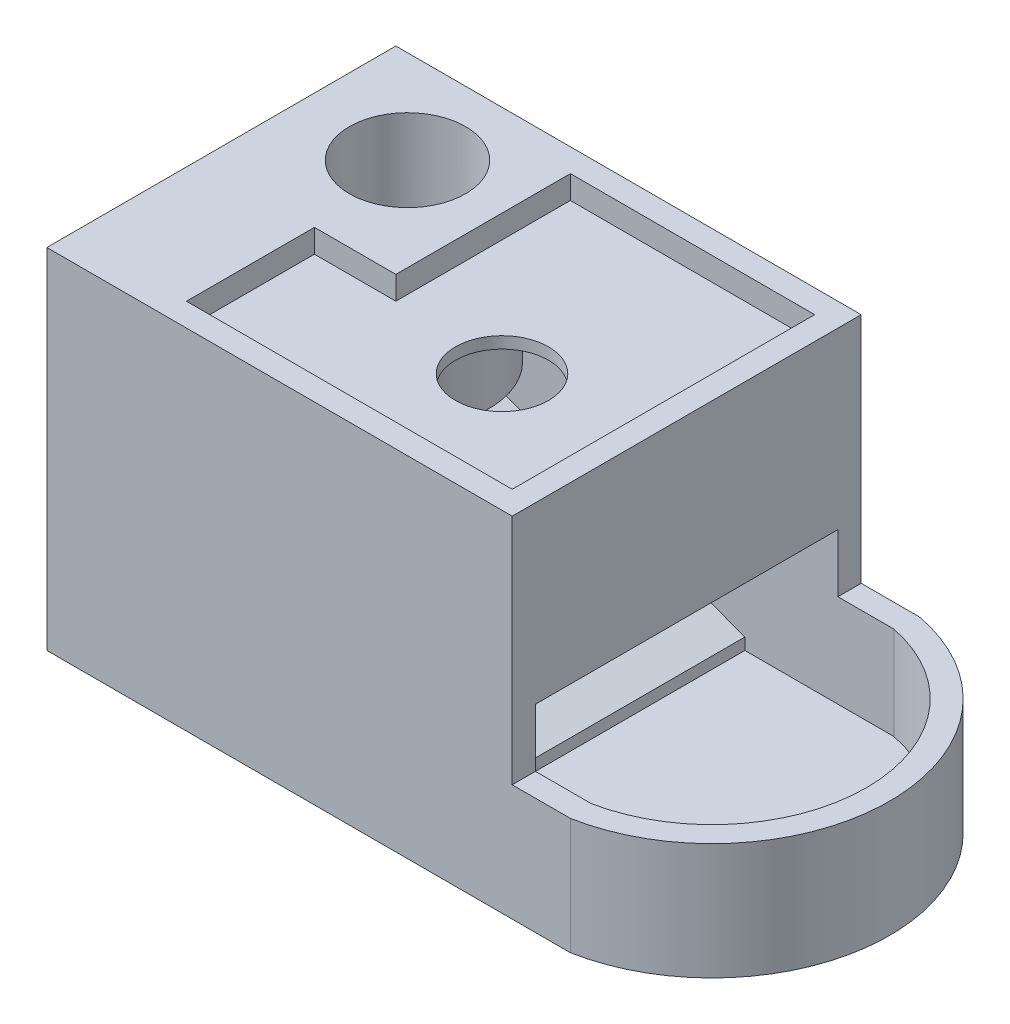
ISO-10303-21;
HEADER;
FILE_DESCRIPTION(('STEP AP214'),'2;1');
FILE_NAME('part.step','',(''),(''),'','','');
FILE_SCHEMA(('AUTOMOTIVE_DESIGN { 1 0 10303 214 1 1 1 1 }'));
ENDSEC;
DATA;
#1=APPLICATION_CONTEXT('core data for automotive mechanical design processes');
#2=APPLICATION_PROTOCOL_DEFINITION('international standard','automotive_design',2000,#1);
#3=PRODUCT_CONTEXT('',#1,'mechanical');
#4=PRODUCT('Part','Part','',(#3));
#5=PRODUCT_RELATED_PRODUCT_CATEGORY('part','',(#4));
#6=PRODUCT_DEFINITION_FORMATION('','',#4);
#7=PRODUCT_DEFINITION_CONTEXT('part definition',#1,'design');
#8=PRODUCT_DEFINITION('design','',#6,#7);
#9=PRODUCT_DEFINITION_SHAPE('','',#8);
#10=(LENGTH_UNIT() NAMED_UNIT(*) SI_UNIT(.MILLI.,.METRE.));
#11=(NAMED_UNIT(*) PLANE_ANGLE_UNIT() SI_UNIT($,.RADIAN.));
#12=(NAMED_UNIT(*) SI_UNIT($,.STERADIAN.) SOLID_ANGLE_UNIT());
#13=UNCERTAINTY_MEASURE_WITH_UNIT(LENGTH_MEASURE(1.E-05),#10,'distance_accuracy_value','');
#14=(GEOMETRIC_REPRESENTATION_CONTEXT(3) GLOBAL_UNCERTAINTY_ASSIGNED_CONTEXT((#13)) GLOBAL_UNIT_ASSIGNED_CONTEXT((#10,
#11,#12)) REPRESENTATION_CONTEXT('',''));
#15=CARTESIAN_POINT('',(0.,0.,0.));
#16=DIRECTION('',(0.,0.,1.));
#17=DIRECTION('',(1.,0.,0.));
#18=AXIS2_PLACEMENT_3D('',#15,#16,#17);
#19=CARTESIAN_POINT('',(3.,27.,41.6173040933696));
#20=DIRECTION('',(0.,1.,0.));
#21=DIRECTION('',(0.,0.,1.));
#22=AXIS2_PLACEMENT_3D('',#19,#20,#21);
#23=PLANE('',#22);
#24=DIRECTION('',(1.,0.,0.));
#25=VECTOR('',#24,1.);
#26=CARTESIAN_POINT('',(3.,27.,-28.));
#27=LINE('',#26,#25);
#28=CARTESIAN_POINT('',(3.,27.,-28.));
#29=VERTEX_POINT('',#28);
#30=CARTESIAN_POINT('',(5.394448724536,27.,-28.));
#31=VERTEX_POINT('',#30);
#32=EDGE_CURVE('E434',#29,#31,#27,.T.);
#33=ORIENTED_EDGE('',*,*,#32,.T.);
#34=CARTESIAN_POINT('',(9.,27.,-22.));
#35=DIRECTION('',(0.,1.,0.));
#36=DIRECTION('',(0.,0.,1.));
#37=AXIS2_PLACEMENT_3D('',#34,#35,#36);
#38=CIRCLE('',#37,7.00000000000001);
#39=CARTESIAN_POINT('',(3.,27.,-25.605551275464));
#40=VERTEX_POINT('',#39);
#41=EDGE_CURVE('E333',#31,#40,#38,.T.);
#42=ORIENTED_EDGE('',*,*,#41,.T.);
#43=DIRECTION('',(0.,0.,-1.));
#44=VECTOR('',#43,1.);
#45=CARTESIAN_POINT('',(3.,27.,41.6173040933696));
#46=LINE('',#45,#44);
#47=EDGE_CURVE('E437',#40,#29,#46,.T.);
#48=ORIENTED_EDGE('',*,*,#47,.T.);
#49=EDGE_LOOP('',(#33,#42,#48));
#50=FACE_BOUND('',#49,.T.);
#51=ADVANCED_FACE('F47',(#50),#23,.F.);
#52=CARTESIAN_POINT('',(0.,30.,0.));
#53=DIRECTION('',(0.,-1.,0.));
#54=DIRECTION('',(0.,0.,-1.));
#55=AXIS2_PLACEMENT_3D('',#52,#53,#54);
#56=PLANE('',#55);
#57=DIRECTION('',(0.,0.,1.));
#58=VECTOR('',#57,1.);
#59=CARTESIAN_POINT('',(0.,30.,0.));
#60=LINE('',#59,#58);
#61=CARTESIAN_POINT('',(0.,30.,-30.));
#62=VERTEX_POINT('',#61);
#63=CARTESIAN_POINT('',(0.,30.,0.));
#64=VERTEX_POINT('',#63);
#65=EDGE_CURVE('E443',#62,#64,#60,.T.);
#66=ORIENTED_EDGE('',*,*,#65,.T.);
#67=DIRECTION('',(1.,0.,0.));
#68=VECTOR('',#67,1.);
#69=CARTESIAN_POINT('',(0.,30.,0.));
#70=LINE('',#69,#68);
#71=CARTESIAN_POINT('',(40.,30.,0.));
#72=VERTEX_POINT('',#71);
#73=EDGE_CURVE('E446',#64,#72,#70,.T.);
#74=ORIENTED_EDGE('',*,*,#73,.T.);
#75=DIRECTION('',(0.,0.,-1.));
#76=VECTOR('',#75,1.);
#77=CARTESIAN_POINT('',(40.,30.,0.));
#78=LINE('',#77,#76);
#79=CARTESIAN_POINT('',(40.,30.,-30.));
#80=VERTEX_POINT('',#79);
#81=EDGE_CURVE('E449',#72,#80,#78,.T.);
#82=ORIENTED_EDGE('',*,*,#81,.T.);
#83=DIRECTION('',(-1.,0.,0.));
#84=VECTOR('',#83,1.);
#85=CARTESIAN_POINT('',(0.,30.,-30.));
#86=LINE('',#85,#84);
#87=EDGE_CURVE('E451',#80,#62,#86,.T.);
#88=ORIENTED_EDGE('',*,*,#87,.T.);
#89=EDGE_LOOP('',(#66,#74,#82,#88));
#90=FACE_BOUND('',#89,.T.);
#91=DIRECTION('',(0.,0.,-1.));
#92=VECTOR('',#91,1.);
#93=CARTESIAN_POINT('',(17.,30.,0.));
#94=LINE('',#93,#92);
#95=CARTESIAN_POINT('',(17.,30.,-13.));
#96=VERTEX_POINT('',#95);
#97=CARTESIAN_POINT('',(17.,30.,-28.));
#98=VERTEX_POINT('',#97);
#99=EDGE_CURVE('E371',#96,#98,#94,.T.);
#100=ORIENTED_EDGE('',*,*,#99,.T.);
#101=DIRECTION('',(1.,0.,0.));
#102=VECTOR('',#101,1.);
#103=CARTESIAN_POINT('',(0.,30.,-28.));
#104=LINE('',#103,#102);
#105=CARTESIAN_POINT('',(38.,30.,-28.));
#106=VERTEX_POINT('',#105);
#107=EDGE_CURVE('E376',#98,#106,#104,.T.);
#108=ORIENTED_EDGE('',*,*,#107,.T.);
#109=DIRECTION('',(0.,0.,1.));
#110=VECTOR('',#109,1.);
#111=CARTESIAN_POINT('',(38.,30.,0.));
#112=LINE('',#111,#110);
#113=CARTESIAN_POINT('',(38.,30.,-2.));
#114=VERTEX_POINT('',#113);
#115=EDGE_CURVE('E400',#106,#114,#112,.T.);
#116=ORIENTED_EDGE('',*,*,#115,.T.);
#117=DIRECTION('',(1.,0.,0.));
#118=VECTOR('',#117,1.);
#119=CARTESIAN_POINT('',(0.,30.,-2.));
#120=LINE('',#119,#118);
#121=CARTESIAN_POINT('',(10.,30.,-2.));
#122=VERTEX_POINT('',#121);
#123=EDGE_CURVE('E397',#122,#114,#120,.T.);
#124=ORIENTED_EDGE('',*,*,#123,.F.);
#125=DIRECTION('',(0.,0.,1.));
#126=VECTOR('',#125,1.);
#127=CARTESIAN_POINT('',(10.,30.,0.));
#128=LINE('',#127,#126);
#129=CARTESIAN_POINT('',(10.,30.,-13.));
#130=VERTEX_POINT('',#129);
#131=EDGE_CURVE('E394',#130,#122,#128,.T.);
#132=ORIENTED_EDGE('',*,*,#131,.F.);
#133=DIRECTION('',(1.,0.,0.));
#134=VECTOR('',#133,1.);
#135=CARTESIAN_POINT('',(0.,30.,-13.));
#136=LINE('',#135,#134);
#137=EDGE_CURVE('E391',#130,#96,#136,.T.);
#138=ORIENTED_EDGE('',*,*,#137,.T.);
#139=EDGE_LOOP('',(#100,#108,#116,#124,#132,#138));
#140=FACE_BOUND('',#139,.T.);
#141=CARTESIAN_POINT('',(9.,30.,-22.));
#142=DIRECTION('',(0.,1.,0.));
#143=DIRECTION('',(0.,0.,1.));
#144=AXIS2_PLACEMENT_3D('',#141,#142,#143);
#145=CIRCLE('',#144,5.);
#146=CARTESIAN_POINT('',(9.,30.,-17.));
#147=VERTEX_POINT('',#146);
#148=EDGE_CURVE('E361',#147,#147,#145,.T.);
#149=ORIENTED_EDGE('',*,*,#148,.F.);
#150=EDGE_LOOP('',(#149));
#151=FACE_BOUND('',#150,.T.);
#152=ADVANCED_FACE('F543',(#90,#140,#151),#56,.F.);
#153=CARTESIAN_POINT('',(0.,30.,0.));
#154=DIRECTION('',(1.,0.,0.));
#155=DIRECTION('',(0.,0.,-1.));
#156=AXIS2_PLACEMENT_3D('',#153,#154,#155);
#157=PLANE('',#156);
#158=DIRECTION('',(0.,-1.,0.));
#159=VECTOR('',#158,1.);
#160=CARTESIAN_POINT('',(0.,30.,-30.));
#161=LINE('',#160,#159);
#162=CARTESIAN_POINT('',(0.,0.,-30.));
#163=VERTEX_POINT('',#162);
#164=EDGE_CURVE('E453',#62,#163,#161,.T.);
#165=ORIENTED_EDGE('',*,*,#164,.T.);
#166=DIRECTION('',(0.,0.,1.));
#167=VECTOR('',#166,1.);
#168=CARTESIAN_POINT('',(0.,0.,0.));
#169=LINE('',#168,#167);
#170=CARTESIAN_POINT('',(0.,0.,0.));
#171=VERTEX_POINT('',#170);
#172=EDGE_CURVE('E427',#163,#171,#169,.T.);
#173=ORIENTED_EDGE('',*,*,#172,.T.);
#174=DIRECTION('',(0.,-1.,0.));
#175=VECTOR('',#174,1.);
#176=CARTESIAN_POINT('',(0.,30.,0.));
#177=LINE('',#176,#175);
#178=EDGE_CURVE('E467',#64,#171,#177,.T.);
#179=ORIENTED_EDGE('',*,*,#178,.F.);
#180=ORIENTED_EDGE('',*,*,#65,.F.);
#181=EDGE_LOOP('',(#165,#173,#179,#180));
#182=FACE_BOUND('',#181,.T.);
#183=ADVANCED_FACE('F49',(#182),#157,.F.);
#184=CARTESIAN_POINT('',(0.,30.,0.));
#185=DIRECTION('',(0.,0.,-1.));
#186=DIRECTION('',(-1.,0.,0.));
#187=AXIS2_PLACEMENT_3D('',#184,#185,#186);
#188=PLANE('',#187);
#189=ORIENTED_EDGE('',*,*,#178,.T.);
#190=DIRECTION('',(1.,0.,0.));
#191=VECTOR('',#190,1.);
#192=CARTESIAN_POINT('',(0.,0.,0.));
#193=LINE('',#192,#191);
#194=CARTESIAN_POINT('',(45.,0.,0.));
#195=VERTEX_POINT('',#194);
#196=EDGE_CURVE('E456',#171,#195,#193,.T.);
#197=ORIENTED_EDGE('',*,*,#196,.T.);
#198=DIRECTION('',(0.,-1.,0.));
#199=VECTOR('',#198,1.);
#200=CARTESIAN_POINT('',(45.,10.,0.));
#201=LINE('',#200,#199);
#202=CARTESIAN_POINT('',(45.,10.,0.));
#203=VERTEX_POINT('',#202);
#204=EDGE_CURVE('E290',#203,#195,#201,.T.);
#205=ORIENTED_EDGE('',*,*,#204,.F.);
#206=DIRECTION('',(-1.,0.,0.));
#207=VECTOR('',#206,1.);
#208=CARTESIAN_POINT('',(0.,10.,0.));
#209=LINE('',#208,#207);
#210=CARTESIAN_POINT('',(40.,10.,0.));
#211=VERTEX_POINT('',#210);
#212=EDGE_CURVE('E285',#203,#211,#209,.T.);
#213=ORIENTED_EDGE('',*,*,#212,.T.);
#214=DIRECTION('',(0.,-1.,0.));
#215=VECTOR('',#214,1.);
#216=CARTESIAN_POINT('',(40.,30.,0.));
#217=LINE('',#216,#215);
#218=EDGE_CURVE('E464',#72,#211,#217,.T.);
#219=ORIENTED_EDGE('',*,*,#218,.F.);
#220=ORIENTED_EDGE('',*,*,#73,.F.);
#221=EDGE_LOOP('',(#189,#197,#205,#213,#219,#220));
#222=FACE_BOUND('',#221,.T.);
#223=ADVANCED_FACE('F662',(#222),#188,.F.);
#224=CARTESIAN_POINT('',(40.,30.,0.));
#225=DIRECTION('',(-1.,0.,0.));
#226=DIRECTION('',(0.,0.,1.));
#227=AXIS2_PLACEMENT_3D('',#224,#225,#226);
#228=PLANE('',#227);
#229=ORIENTED_EDGE('',*,*,#218,.T.);
#230=DIRECTION('',(0.,0.,-1.));
#231=VECTOR('',#230,1.);
#232=CARTESIAN_POINT('',(40.,10.,0.));
#233=LINE('',#232,#231);
#234=CARTESIAN_POINT('',(40.,10.,-2.));
#235=VERTEX_POINT('',#234);
#236=EDGE_CURVE('E57',#211,#235,#233,.T.);
#237=ORIENTED_EDGE('',*,*,#236,.T.);
#238=DIRECTION('',(0.,-1.,0.));
#239=VECTOR('',#238,1.);
#240=CARTESIAN_POINT('',(40.,2.,-2.));
#241=LINE('',#240,#239);
#242=CARTESIAN_POINT('',(40.,15.,-2.));
#243=VERTEX_POINT('',#242);
#244=EDGE_CURVE('E337',#243,#235,#241,.T.);
#245=ORIENTED_EDGE('',*,*,#244,.F.);
#246=DIRECTION('',(0.,0.,1.));
#247=VECTOR('',#246,1.);
#248=CARTESIAN_POINT('',(40.,15.,-2.));
#249=LINE('',#248,#247);
#250=CARTESIAN_POINT('',(40.,15.,-28.));
#251=VERTEX_POINT('',#250);
#252=EDGE_CURVE('E340',#251,#243,#249,.T.);
#253=ORIENTED_EDGE('',*,*,#252,.F.);
#254=DIRECTION('',(0.,1.,0.));
#255=VECTOR('',#254,1.);
#256=CARTESIAN_POINT('',(40.,2.,-28.));
#257=LINE('',#256,#255);
#258=CARTESIAN_POINT('',(40.,10.,-28.));
#259=VERTEX_POINT('',#258);
#260=EDGE_CURVE('E344',#259,#251,#257,.T.);
#261=ORIENTED_EDGE('',*,*,#260,.F.);
#262=CARTESIAN_POINT('',(40.,10.,-30.));
#263=VERTEX_POINT('',#262);
#264=EDGE_CURVE('E12',#259,#263,#233,.T.);
#265=ORIENTED_EDGE('',*,*,#264,.T.);
#266=DIRECTION('',(0.,-1.,0.));
#267=VECTOR('',#266,1.);
#268=CARTESIAN_POINT('',(40.,30.,-30.));
#269=LINE('',#268,#267);
#270=EDGE_CURVE('E461',#80,#263,#269,.T.);
#271=ORIENTED_EDGE('',*,*,#270,.F.);
#272=ORIENTED_EDGE('',*,*,#81,.F.);
#273=EDGE_LOOP('',(#229,#237,#245,#253,#261,#265,#271,#272));
#274=FACE_BOUND('',#273,.T.);
#275=ADVANCED_FACE('F656',(#274),#228,.F.);
#276=CARTESIAN_POINT('',(0.,30.,-30.));
#277=DIRECTION('',(0.,0.,1.));
#278=DIRECTION('',(1.,0.,0.));
#279=AXIS2_PLACEMENT_3D('',#276,#277,#278);
#280=PLANE('',#279);
#281=ORIENTED_EDGE('',*,*,#270,.T.);
#282=DIRECTION('',(1.,0.,0.));
#283=VECTOR('',#282,1.);
#284=CARTESIAN_POINT('',(0.,10.,-30.));
#285=LINE('',#284,#283);
#286=CARTESIAN_POINT('',(45.,10.,-30.));
#287=VERTEX_POINT('',#286);
#288=EDGE_CURVE('E64',#263,#287,#285,.T.);
#289=ORIENTED_EDGE('',*,*,#288,.T.);
#290=DIRECTION('',(0.,-1.,0.));
#291=VECTOR('',#290,1.);
#292=CARTESIAN_POINT('',(45.,10.,-30.));
#293=LINE('',#292,#291);
#294=CARTESIAN_POINT('',(45.,0.,-30.));
#295=VERTEX_POINT('',#294);
#296=EDGE_CURVE('E293',#287,#295,#293,.T.);
#297=ORIENTED_EDGE('',*,*,#296,.T.);
#298=DIRECTION('',(-1.,0.,0.));
#299=VECTOR('',#298,1.);
#300=CARTESIAN_POINT('',(0.,0.,-30.));
#301=LINE('',#300,#299);
#302=EDGE_CURVE('E447',#295,#163,#301,.T.);
#303=ORIENTED_EDGE('',*,*,#302,.T.);
#304=ORIENTED_EDGE('',*,*,#164,.F.);
#305=ORIENTED_EDGE('',*,*,#87,.F.);
#306=EDGE_LOOP('',(#281,#289,#297,#303,#304,#305));
#307=FACE_BOUND('',#306,.T.);
#308=ADVANCED_FACE('F648',(#307),#280,.F.);
#309=CARTESIAN_POINT('',(0.,0.,0.));
#310=DIRECTION('',(0.,-1.,0.));
#311=DIRECTION('',(0.,0.,-1.));
#312=AXIS2_PLACEMENT_3D('',#309,#310,#311);
#313=PLANE('',#312);
#314=ORIENTED_EDGE('',*,*,#172,.F.);
#315=ORIENTED_EDGE('',*,*,#302,.F.);
#316=CARTESIAN_POINT('',(42.1810205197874,0.,-15.));
#317=DIRECTION('',(0.,-1.,0.));
#318=DIRECTION('',(0.,0.,-1.));
#319=AXIS2_PLACEMENT_3D('',#316,#317,#318);
#320=CIRCLE('',#319,15.262589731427);
#321=EDGE_CURVE('E280',#295,#195,#320,.T.);
#322=ORIENTED_EDGE('',*,*,#321,.T.);
#323=ORIENTED_EDGE('',*,*,#196,.F.);
#324=EDGE_LOOP('',(#314,#315,#322,#323));
#325=FACE_BOUND('',#324,.T.);
#326=ADVANCED_FACE('F557',(#325),#313,.T.);
#327=CARTESIAN_POINT('',(17.,28.,0.));
#328=DIRECTION('',(1.,0.,0.));
#329=DIRECTION('',(0.,0.,-1.));
#330=AXIS2_PLACEMENT_3D('',#327,#328,#329);
#331=PLANE('',#330);
#332=ORIENTED_EDGE('',*,*,#99,.F.);
#333=DIRECTION('',(0.,1.,0.));
#334=VECTOR('',#333,1.);
#335=CARTESIAN_POINT('',(17.,28.,-13.));
#336=LINE('',#335,#334);
#337=CARTESIAN_POINT('',(17.,28.,-13.));
#338=VERTEX_POINT('',#337);
#339=EDGE_CURVE('E388',#338,#96,#336,.T.);
#340=ORIENTED_EDGE('',*,*,#339,.F.);
#341=DIRECTION('',(0.,0.,-1.));
#342=VECTOR('',#341,1.);
#343=CARTESIAN_POINT('',(17.,28.,0.));
#344=LINE('',#343,#342);
#345=CARTESIAN_POINT('',(17.,28.,-28.));
#346=VERTEX_POINT('',#345);
#347=EDGE_CURVE('E372',#338,#346,#344,.T.);
#348=ORIENTED_EDGE('',*,*,#347,.T.);
#349=DIRECTION('',(0.,1.,0.));
#350=VECTOR('',#349,1.);
#351=CARTESIAN_POINT('',(17.,28.,-28.));
#352=LINE('',#351,#350);
#353=EDGE_CURVE('E405',#346,#98,#352,.T.);
#354=ORIENTED_EDGE('',*,*,#353,.T.);
#355=EDGE_LOOP('',(#332,#340,#348,#354));
#356=FACE_BOUND('',#355,.T.);
#357=ADVANCED_FACE('F553',(#356),#331,.T.);
#358=CARTESIAN_POINT('',(0.,28.,-28.));
#359=DIRECTION('',(0.,0.,1.));
#360=DIRECTION('',(1.,0.,0.));
#361=AXIS2_PLACEMENT_3D('',#358,#359,#360);
#362=PLANE('',#361);
#363=ORIENTED_EDGE('',*,*,#107,.F.);
#364=ORIENTED_EDGE('',*,*,#353,.F.);
#365=DIRECTION('',(1.,0.,0.));
#366=VECTOR('',#365,1.);
#367=CARTESIAN_POINT('',(0.,28.,-28.));
#368=LINE('',#367,#366);
#369=CARTESIAN_POINT('',(38.,28.,-28.));
#370=VERTEX_POINT('',#369);
#371=EDGE_CURVE('E386',#346,#370,#368,.T.);
#372=ORIENTED_EDGE('',*,*,#371,.T.);
#373=DIRECTION('',(0.,1.,0.));
#374=VECTOR('',#373,1.);
#375=CARTESIAN_POINT('',(38.,28.,-28.));
#376=LINE('',#375,#374);
#377=EDGE_CURVE('E409',#370,#106,#376,.T.);
#378=ORIENTED_EDGE('',*,*,#377,.T.);
#379=EDGE_LOOP('',(#363,#364,#372,#378));
#380=FACE_BOUND('',#379,.T.);
#381=ADVANCED_FACE('F556',(#380),#362,.T.);
#382=CARTESIAN_POINT('',(38.,28.,0.));
#383=DIRECTION('',(-1.,0.,0.));
#384=DIRECTION('',(0.,0.,1.));
#385=AXIS2_PLACEMENT_3D('',#382,#383,#384);
#386=PLANE('',#385);
#387=ORIENTED_EDGE('',*,*,#115,.F.);
#388=ORIENTED_EDGE('',*,*,#377,.F.);
#389=DIRECTION('',(0.,0.,1.));
#390=VECTOR('',#389,1.);
#391=CARTESIAN_POINT('',(38.,28.,0.));
#392=LINE('',#391,#390);
#393=CARTESIAN_POINT('',(38.,28.,-2.));
#394=VERTEX_POINT('',#393);
#395=EDGE_CURVE('E384',#370,#394,#392,.T.);
#396=ORIENTED_EDGE('',*,*,#395,.T.);
#397=DIRECTION('',(0.,1.,0.));
#398=VECTOR('',#397,1.);
#399=CARTESIAN_POINT('',(38.,28.,-2.));
#400=LINE('',#399,#398);
#401=EDGE_CURVE('E411',#394,#114,#400,.T.);
#402=ORIENTED_EDGE('',*,*,#401,.T.);
#403=EDGE_LOOP('',(#387,#388,#396,#402));
#404=FACE_BOUND('',#403,.T.);
#405=ADVANCED_FACE('F571',(#404),#386,.T.);
#406=CARTESIAN_POINT('',(0.,28.,-2.));
#407=DIRECTION('',(0.,0.,1.));
#408=DIRECTION('',(1.,0.,0.));
#409=AXIS2_PLACEMENT_3D('',#406,#407,#408);
#410=PLANE('',#409);
#411=ORIENTED_EDGE('',*,*,#123,.T.);
#412=ORIENTED_EDGE('',*,*,#401,.F.);
#413=DIRECTION('',(1.,0.,0.));
#414=VECTOR('',#413,1.);
#415=CARTESIAN_POINT('',(0.,28.,-2.));
#416=LINE('',#415,#414);
#417=CARTESIAN_POINT('',(10.,28.,-2.));
#418=VERTEX_POINT('',#417);
#419=EDGE_CURVE('E381',#418,#394,#416,.T.);
#420=ORIENTED_EDGE('',*,*,#419,.F.);
#421=DIRECTION('',(0.,1.,0.));
#422=VECTOR('',#421,1.);
#423=CARTESIAN_POINT('',(10.,28.,-2.));
#424=LINE('',#423,#422);
#425=EDGE_CURVE('E413',#418,#122,#424,.T.);
#426=ORIENTED_EDGE('',*,*,#425,.T.);
#427=EDGE_LOOP('',(#411,#412,#420,#426));
#428=FACE_BOUND('',#427,.T.);
#429=ADVANCED_FACE('F567',(#428),#410,.F.);
#430=CARTESIAN_POINT('',(10.,28.,0.));
#431=DIRECTION('',(-1.,0.,0.));
#432=DIRECTION('',(0.,0.,1.));
#433=AXIS2_PLACEMENT_3D('',#430,#431,#432);
#434=PLANE('',#433);
#435=ORIENTED_EDGE('',*,*,#131,.T.);
#436=ORIENTED_EDGE('',*,*,#425,.F.);
#437=DIRECTION('',(0.,0.,1.));
#438=VECTOR('',#437,1.);
#439=CARTESIAN_POINT('',(10.,28.,0.));
#440=LINE('',#439,#438);
#441=CARTESIAN_POINT('',(10.,28.,-13.));
#442=VERTEX_POINT('',#441);
#443=EDGE_CURVE('E378',#442,#418,#440,.T.);
#444=ORIENTED_EDGE('',*,*,#443,.F.);
#445=DIRECTION('',(0.,1.,0.));
#446=VECTOR('',#445,1.);
#447=CARTESIAN_POINT('',(10.,28.,-13.));
#448=LINE('',#447,#446);
#449=EDGE_CURVE('E415',#442,#130,#448,.T.);
#450=ORIENTED_EDGE('',*,*,#449,.T.);
#451=EDGE_LOOP('',(#435,#436,#444,#450));
#452=FACE_BOUND('',#451,.T.);
#453=ADVANCED_FACE('F563',(#452),#434,.F.);
#454=CARTESIAN_POINT('',(0.,28.,-13.));
#455=DIRECTION('',(0.,0.,1.));
#456=DIRECTION('',(1.,0.,0.));
#457=AXIS2_PLACEMENT_3D('',#454,#455,#456);
#458=PLANE('',#457);
#459=ORIENTED_EDGE('',*,*,#137,.F.);
#460=ORIENTED_EDGE('',*,*,#449,.F.);
#461=DIRECTION('',(1.,0.,0.));
#462=VECTOR('',#461,1.);
#463=CARTESIAN_POINT('',(0.,28.,-13.));
#464=LINE('',#463,#462);
#465=EDGE_CURVE('E375',#442,#338,#464,.T.);
#466=ORIENTED_EDGE('',*,*,#465,.T.);
#467=ORIENTED_EDGE('',*,*,#339,.T.);
#468=EDGE_LOOP('',(#459,#460,#466,#467));
#469=FACE_BOUND('',#468,.T.);
#470=ADVANCED_FACE('F559',(#469),#458,.T.);
#471=CARTESIAN_POINT('',(0.,28.,0.));
#472=DIRECTION('',(0.,1.,0.));
#473=DIRECTION('',(0.,0.,1.));
#474=AXIS2_PLACEMENT_3D('',#471,#472,#473);
#475=PLANE('',#474);
#476=CARTESIAN_POINT('',(26.954356,28.,-12.169873));
#477=DIRECTION('',(0.,1.,0.));
#478=DIRECTION('',(0.,0.,1.));
#479=AXIS2_PLACEMENT_3D('',#476,#477,#478);
#480=CIRCLE('',#479,4.);
#481=CARTESIAN_POINT('',(26.954356,28.,-8.169873));
#482=VERTEX_POINT('',#481);
#483=EDGE_CURVE('E358',#482,#482,#480,.T.);
#484=ORIENTED_EDGE('',*,*,#483,.F.);
#485=EDGE_LOOP('',(#484));
#486=FACE_BOUND('',#485,.T.);
#487=ORIENTED_EDGE('',*,*,#347,.F.);
#488=ORIENTED_EDGE('',*,*,#465,.F.);
#489=ORIENTED_EDGE('',*,*,#443,.T.);
#490=ORIENTED_EDGE('',*,*,#419,.T.);
#491=ORIENTED_EDGE('',*,*,#395,.F.);
#492=ORIENTED_EDGE('',*,*,#371,.F.);
#493=EDGE_LOOP('',(#487,#488,#489,#490,#491,#492));
#494=FACE_BOUND('',#493,.T.);
#495=ADVANCED_FACE('F562',(#486,#494),#475,.T.);
#496=CARTESIAN_POINT('',(9.,25.,-22.));
#497=DIRECTION('',(0.,1.,0.));
#498=DIRECTION('',(0.,0.,1.));
#499=AXIS2_PLACEMENT_3D('',#496,#497,#498);
#500=CYLINDRICAL_SURFACE('',#499,5.);
#501=CARTESIAN_POINT('',(9.,17.,-22.));
#502=DIRECTION('',(0.,1.,0.));
#503=DIRECTION('',(0.,0.,1.));
#504=AXIS2_PLACEMENT_3D('',#501,#502,#503);
#505=CIRCLE('',#504,5.);
#506=CARTESIAN_POINT('',(11.5,17.,-17.6698729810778));
#507=VERTEX_POINT('',#506);
#508=CARTESIAN_POINT('',(6.50000000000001,17.,-17.6698729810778));
#509=VERTEX_POINT('',#508);
#510=EDGE_CURVE('E318',#507,#509,#505,.T.);
#511=ORIENTED_EDGE('',*,*,#510,.F.);
#512=DIRECTION('',(0.,1.,0.));
#513=VECTOR('',#512,1.);
#514=CARTESIAN_POINT('',(11.5,17.,-17.6698729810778));
#515=LINE('',#514,#513);
#516=CARTESIAN_POINT('',(11.5,27.,-17.6698729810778));
#517=VERTEX_POINT('',#516);
#518=EDGE_CURVE('E305',#507,#517,#515,.T.);
#519=ORIENTED_EDGE('',*,*,#518,.T.);
#520=CARTESIAN_POINT('',(9.00000000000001,27.,-22.));
#521=DIRECTION('',(0.,1.,0.));
#522=DIRECTION('',(0.,0.,1.));
#523=AXIS2_PLACEMENT_3D('',#520,#521,#522);
#524=CIRCLE('',#523,5.);
#525=CARTESIAN_POINT('',(6.50000000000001,27.,-17.6698729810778));
#526=VERTEX_POINT('',#525);
#527=EDGE_CURVE('E307',#526,#517,#524,.T.);
#528=ORIENTED_EDGE('',*,*,#527,.F.);
#529=DIRECTION('',(0.,1.,0.));
#530=VECTOR('',#529,1.);
#531=CARTESIAN_POINT('',(6.50000000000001,17.,-17.6698729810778));
#532=LINE('',#531,#530);
#533=EDGE_CURVE('E310',#509,#526,#532,.T.);
#534=ORIENTED_EDGE('',*,*,#533,.F.);
#535=EDGE_LOOP('',(#511,#519,#528,#534));
#536=FACE_BOUND('',#535,.T.);
#537=ORIENTED_EDGE('',*,*,#148,.T.);
#538=EDGE_LOOP('',(#537));
#539=FACE_BOUND('',#538,.T.);
#540=ADVANCED_FACE('F497',(#536,#539),#500,.F.);
#541=CARTESIAN_POINT('',(37.,27.,41.6173040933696));
#542=DIRECTION('',(1.,0.,0.));
#543=DIRECTION('',(0.,0.,-1.));
#544=AXIS2_PLACEMENT_3D('',#541,#542,#543);
#545=PLANE('',#544);
#546=DIRECTION('',(0.,-1.,0.));
#547=VECTOR('',#546,1.);
#548=CARTESIAN_POINT('',(37.,27.,-28.));
#549=LINE('',#548,#547);
#550=CARTESIAN_POINT('',(37.,27.,-28.));
#551=VERTEX_POINT('',#550);
#552=CARTESIAN_POINT('',(37.,15.,-28.));
#553=VERTEX_POINT('',#552);
#554=EDGE_CURVE('E408',#551,#553,#549,.T.);
#555=ORIENTED_EDGE('',*,*,#554,.T.);
#556=DIRECTION('',(0.,0.,1.));
#557=VECTOR('',#556,1.);
#558=CARTESIAN_POINT('',(37.,15.,41.6173040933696));
#559=LINE('',#558,#557);
#560=CARTESIAN_POINT('',(37.,15.,-2.));
#561=VERTEX_POINT('',#560);
#562=EDGE_CURVE('E350',#553,#561,#559,.T.);
#563=ORIENTED_EDGE('',*,*,#562,.T.);
#564=DIRECTION('',(0.,1.,0.));
#565=VECTOR('',#564,1.);
#566=CARTESIAN_POINT('',(37.,27.,-2.));
#567=LINE('',#566,#565);
#568=CARTESIAN_POINT('',(37.,27.,-2.));
#569=VERTEX_POINT('',#568);
#570=EDGE_CURVE('E425',#561,#569,#567,.T.);
#571=ORIENTED_EDGE('',*,*,#570,.T.);
#572=DIRECTION('',(0.,0.,-1.));
#573=VECTOR('',#572,1.);
#574=CARTESIAN_POINT('',(37.,27.,41.6173040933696));
#575=LINE('',#574,#573);
#576=EDGE_CURVE('E423',#569,#551,#575,.T.);
#577=ORIENTED_EDGE('',*,*,#576,.T.);
#578=EDGE_LOOP('',(#555,#563,#571,#577));
#579=FACE_BOUND('',#578,.T.);
#580=ADVANCED_FACE('F526',(#579),#545,.F.);
#581=DIRECTION('',(0.,0.,-1.));
#582=VECTOR('',#581,1.);
#583=CARTESIAN_POINT('',(11.5000000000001,27.,41.6173040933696));
#584=LINE('',#583,#582);
#585=CARTESIAN_POINT('',(11.5,27.,-15.461651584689));
#586=VERTEX_POINT('',#585);
#587=EDGE_CURVE('E71',#586,#517,#584,.T.);
#588=ORIENTED_EDGE('',*,*,#587,.F.);
#589=CARTESIAN_POINT('',(12.605551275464,27.,-28.));
#590=VERTEX_POINT('',#589);
#591=EDGE_CURVE('E328',#586,#590,#38,.T.);
#592=ORIENTED_EDGE('',*,*,#591,.T.);
#593=EDGE_CURVE('E433',#590,#551,#27,.T.);
#594=ORIENTED_EDGE('',*,*,#593,.T.);
#595=ORIENTED_EDGE('',*,*,#576,.F.);
#596=DIRECTION('',(-1.,0.,0.));
#597=VECTOR('',#596,1.);
#598=CARTESIAN_POINT('',(3.,27.,-2.));
#599=LINE('',#598,#597);
#600=CARTESIAN_POINT('',(3.,27.,-2.));
#601=VERTEX_POINT('',#600);
#602=EDGE_CURVE('E422',#569,#601,#599,.T.);
#603=ORIENTED_EDGE('',*,*,#602,.T.);
#604=CARTESIAN_POINT('',(3.,27.,-18.394448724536));
#605=VERTEX_POINT('',#604);
#606=EDGE_CURVE('E440',#601,#605,#46,.T.);
#607=ORIENTED_EDGE('',*,*,#606,.T.);
#608=CARTESIAN_POINT('',(6.50000000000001,27.,-15.461651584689));
#609=VERTEX_POINT('',#608);
#610=EDGE_CURVE('E329',#605,#609,#38,.T.);
#611=ORIENTED_EDGE('',*,*,#610,.T.);
#612=DIRECTION('',(0.,0.,1.));
#613=VECTOR('',#612,1.);
#614=CARTESIAN_POINT('',(6.50000000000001,27.,41.6173040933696));
#615=LINE('',#614,#613);
#616=EDGE_CURVE('E302',#526,#609,#615,.T.);
#617=ORIENTED_EDGE('',*,*,#616,.F.);
#618=ORIENTED_EDGE('',*,*,#527,.T.);
#619=EDGE_LOOP('',(#588,#592,#594,#595,#603,#607,#611,#617,#618));
#620=FACE_BOUND('',#619,.T.);
#621=CARTESIAN_POINT('',(26.954356,27.,-12.169873));
#622=DIRECTION('',(0.,1.,0.));
#623=DIRECTION('',(0.,0.,1.));
#624=AXIS2_PLACEMENT_3D('',#621,#622,#623);
#625=CIRCLE('',#624,4.);
#626=CARTESIAN_POINT('',(26.954356,27.,-8.169873));
#627=VERTEX_POINT('',#626);
#628=EDGE_CURVE('E357',#627,#627,#625,.T.);
#629=ORIENTED_EDGE('',*,*,#628,.T.);
#630=EDGE_LOOP('',(#629));
#631=FACE_BOUND('',#630,.T.);
#632=ADVANCED_FACE('F503',(#620,#631),#23,.F.);
#633=CARTESIAN_POINT('',(3.,3.,41.6173040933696));
#634=DIRECTION('',(-1.,0.,0.));
#635=DIRECTION('',(0.,0.,1.));
#636=AXIS2_PLACEMENT_3D('',#633,#634,#635);
#637=PLANE('',#636);
#638=DIRECTION('',(0.,0.,-1.));
#639=VECTOR('',#638,1.);
#640=CARTESIAN_POINT('',(3.,15.,41.6173040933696));
#641=LINE('',#640,#639);
#642=CARTESIAN_POINT('',(3.,15.,-18.394448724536));
#643=VERTEX_POINT('',#642);
#644=CARTESIAN_POINT('',(3.,15.,-25.605551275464));
#645=VERTEX_POINT('',#644);
#646=EDGE_CURVE('E325',#643,#645,#641,.T.);
#647=ORIENTED_EDGE('',*,*,#646,.F.);
#648=DIRECTION('',(0.,1.,0.));
#649=VECTOR('',#648,1.);
#650=CARTESIAN_POINT('',(3.,15.,-18.394448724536));
#651=LINE('',#650,#649);
#652=EDGE_CURVE('E332',#643,#605,#651,.T.);
#653=ORIENTED_EDGE('',*,*,#652,.T.);
#654=ORIENTED_EDGE('',*,*,#606,.F.);
#655=DIRECTION('',(0.,-1.,0.));
#656=VECTOR('',#655,1.);
#657=CARTESIAN_POINT('',(3.,3.,-2.));
#658=LINE('',#657,#656);
#659=CARTESIAN_POINT('',(3.,13.875,-2.));
#660=VERTEX_POINT('',#659);
#661=EDGE_CURVE('E419',#601,#660,#658,.T.);
#662=ORIENTED_EDGE('',*,*,#661,.T.);
#663=DIRECTION('',(0.,0.,-1.));
#664=VECTOR('',#663,1.);
#665=CARTESIAN_POINT('',(3.,13.875,41.6173040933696));
#666=LINE('',#665,#664);
#667=CARTESIAN_POINT('',(3.,13.875,-28.));
#668=VERTEX_POINT('',#667);
#669=EDGE_CURVE('E366',#660,#668,#666,.T.);
#670=ORIENTED_EDGE('',*,*,#669,.T.);
#671=DIRECTION('',(0.,1.,0.));
#672=VECTOR('',#671,1.);
#673=CARTESIAN_POINT('',(3.,3.,-28.));
#674=LINE('',#673,#672);
#675=EDGE_CURVE('E430',#668,#29,#674,.T.);
#676=ORIENTED_EDGE('',*,*,#675,.T.);
#677=ORIENTED_EDGE('',*,*,#47,.F.);
#678=DIRECTION('',(0.,1.,0.));
#679=VECTOR('',#678,1.);
#680=CARTESIAN_POINT('',(3.,15.,-25.605551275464));
#681=LINE('',#680,#679);
#682=EDGE_CURVE('E335',#40,#645,#681,.F.);
#683=ORIENTED_EDGE('',*,*,#682,.T.);
#684=EDGE_LOOP('',(#647,#653,#654,#662,#670,#676,#677,#683));
#685=FACE_BOUND('',#684,.T.);
#686=ADVANCED_FACE('F530',(#685),#637,.F.);
#687=CARTESIAN_POINT('',(0.,0.,-28.));
#688=DIRECTION('',(0.,0.,-1.));
#689=DIRECTION('',(-1.,0.,0.));
#690=AXIS2_PLACEMENT_3D('',#687,#688,#689);
#691=PLANE('',#690);
#692=DIRECTION('',(1.,0.,0.));
#693=VECTOR('',#692,1.);
#694=CARTESIAN_POINT('',(0.,15.,-28.));
#695=LINE('',#694,#693);
#696=CARTESIAN_POINT('',(5.394448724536,15.,-28.));
#697=VERTEX_POINT('',#696);
#698=CARTESIAN_POINT('',(12.605551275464,15.,-28.));
#699=VERTEX_POINT('',#698);
#700=EDGE_CURVE('E472',#697,#699,#695,.T.);
#701=ORIENTED_EDGE('',*,*,#700,.F.);
#702=DIRECTION('',(0.,1.,0.));
#703=VECTOR('',#702,1.);
#704=CARTESIAN_POINT('',(5.394448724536,15.,-28.));
#705=LINE('',#704,#703);
#706=EDGE_CURVE('E478',#697,#31,#705,.T.);
#707=ORIENTED_EDGE('',*,*,#706,.T.);
#708=ORIENTED_EDGE('',*,*,#32,.F.);
#709=ORIENTED_EDGE('',*,*,#675,.F.);
#710=DIRECTION('',(0.936329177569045,-0.351123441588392,0.));
#711=VECTOR('',#710,1.);
#712=CARTESIAN_POINT('',(4.93150684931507,13.1506849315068,-28.));
#713=LINE('',#712,#711);
#714=CARTESIAN_POINT('',(32.,3.,-28.));
#715=VERTEX_POINT('',#714);
#716=EDGE_CURVE('E368',#668,#715,#713,.T.);
#717=ORIENTED_EDGE('',*,*,#716,.T.);
#718=DIRECTION('',(0.,1.,0.));
#719=VECTOR('',#718,1.);
#720=CARTESIAN_POINT('',(32.,2.,-28.));
#721=LINE('',#720,#719);
#722=CARTESIAN_POINT('',(32.,2.,-28.));
#723=VERTEX_POINT('',#722);
#724=EDGE_CURVE('E258',#723,#715,#721,.T.);
#725=ORIENTED_EDGE('',*,*,#724,.F.);
#726=DIRECTION('',(1.,0.,0.));
#727=VECTOR('',#726,1.);
#728=CARTESIAN_POINT('',(32.,2.,-28.));
#729=LINE('',#728,#727);
#730=CARTESIAN_POINT('',(44.8070986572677,2.,-28.));
#731=VERTEX_POINT('',#730);
#732=EDGE_CURVE('E257',#723,#731,#729,.T.);
#733=ORIENTED_EDGE('',*,*,#732,.T.);
#734=DIRECTION('',(0.,1.,0.));
#735=VECTOR('',#734,1.);
#736=CARTESIAN_POINT('',(44.8070986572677,2.,-28.));
#737=LINE('',#736,#735);
#738=CARTESIAN_POINT('',(44.8070986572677,10.,-28.));
#739=VERTEX_POINT('',#738);
#740=EDGE_CURVE('E269',#731,#739,#737,.T.);
#741=ORIENTED_EDGE('',*,*,#740,.T.);
#742=DIRECTION('',(-1.,0.,0.));
#743=VECTOR('',#742,1.);
#744=CARTESIAN_POINT('',(42.,10.,-28.));
#745=LINE('',#744,#743);
#746=EDGE_CURVE('E273',#739,#259,#745,.T.);
#747=ORIENTED_EDGE('',*,*,#746,.T.);
#748=ORIENTED_EDGE('',*,*,#260,.T.);
#749=DIRECTION('',(1.,0.,0.));
#750=VECTOR('',#749,1.);
#751=CARTESIAN_POINT('',(32.,15.,-28.));
#752=LINE('',#751,#750);
#753=EDGE_CURVE('E351',#553,#251,#752,.T.);
#754=ORIENTED_EDGE('',*,*,#753,.F.);
#755=ORIENTED_EDGE('',*,*,#554,.F.);
#756=ORIENTED_EDGE('',*,*,#593,.F.);
#757=DIRECTION('',(0.,1.,0.));
#758=VECTOR('',#757,1.);
#759=CARTESIAN_POINT('',(12.605551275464,15.,-28.));
#760=LINE('',#759,#758);
#761=EDGE_CURVE('E477',#590,#699,#760,.F.);
#762=ORIENTED_EDGE('',*,*,#761,.T.);
#763=EDGE_LOOP('',(#701,#707,#708,#709,#717,#725,#733,#741,#747,#748,#754,#755,#756,#762));
#764=FACE_BOUND('',#763,.T.);
#765=ADVANCED_FACE('F514',(#764),#691,.F.);
#766=CARTESIAN_POINT('',(0.,30.,-2.));
#767=DIRECTION('',(0.,0.,-1.));
#768=DIRECTION('',(-1.,0.,0.));
#769=AXIS2_PLACEMENT_3D('',#766,#767,#768);
#770=PLANE('',#769);
#771=ORIENTED_EDGE('',*,*,#570,.F.);
#772=DIRECTION('',(1.,0.,0.));
#773=VECTOR('',#772,1.);
#774=CARTESIAN_POINT('',(32.,15.,-2.));
#775=LINE('',#774,#773);
#776=EDGE_CURVE('E348',#561,#243,#775,.T.);
#777=ORIENTED_EDGE('',*,*,#776,.T.);
#778=ORIENTED_EDGE('',*,*,#244,.T.);
#779=DIRECTION('',(1.,0.,0.));
#780=VECTOR('',#779,1.);
#781=CARTESIAN_POINT('',(42.,10.,-2.));
#782=LINE('',#781,#780);
#783=CARTESIAN_POINT('',(44.8070986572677,10.,-2.));
#784=VERTEX_POINT('',#783);
#785=EDGE_CURVE('E265',#235,#784,#782,.T.);
#786=ORIENTED_EDGE('',*,*,#785,.T.);
#787=DIRECTION('',(0.,1.,0.));
#788=VECTOR('',#787,1.);
#789=CARTESIAN_POINT('',(44.8070986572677,2.,-2.));
#790=LINE('',#789,#788);
#791=CARTESIAN_POINT('',(44.8070986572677,2.,-2.));
#792=VERTEX_POINT('',#791);
#793=EDGE_CURVE('E261',#792,#784,#790,.T.);
#794=ORIENTED_EDGE('',*,*,#793,.F.);
#795=DIRECTION('',(1.,0.,0.));
#796=VECTOR('',#795,1.);
#797=CARTESIAN_POINT('',(32.,2.,-2.));
#798=LINE('',#797,#796);
#799=CARTESIAN_POINT('',(32.,2.,-2.));
#800=VERTEX_POINT('',#799);
#801=EDGE_CURVE('E248',#800,#792,#798,.T.);
#802=ORIENTED_EDGE('',*,*,#801,.F.);
#803=DIRECTION('',(0.,-1.,0.));
#804=VECTOR('',#803,1.);
#805=CARTESIAN_POINT('',(32.,2.,-2.));
#806=LINE('',#805,#804);
#807=CARTESIAN_POINT('',(32.,3.,-2.));
#808=VERTEX_POINT('',#807);
#809=EDGE_CURVE('E338',#808,#800,#806,.T.);
#810=ORIENTED_EDGE('',*,*,#809,.F.);
#811=DIRECTION('',(0.936329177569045,-0.351123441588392,0.));
#812=VECTOR('',#811,1.);
#813=CARTESIAN_POINT('',(-4.93150684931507,16.8493150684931,-2.));
#814=LINE('',#813,#812);
#815=EDGE_CURVE('E469',#660,#808,#814,.T.);
#816=ORIENTED_EDGE('',*,*,#815,.F.);
#817=ORIENTED_EDGE('',*,*,#661,.F.);
#818=ORIENTED_EDGE('',*,*,#602,.F.);
#819=EDGE_LOOP('',(#771,#777,#778,#786,#794,#802,#810,#816,#817,#818));
#820=FACE_BOUND('',#819,.T.);
#821=ADVANCED_FACE('F263',(#820),#770,.T.);
#822=CARTESIAN_POINT('',(40.,0.,0.));
#823=DIRECTION('',(0.351123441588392,0.936329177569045,0.));
#824=DIRECTION('',(-0.936329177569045,0.351123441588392,0.));
#825=AXIS2_PLACEMENT_3D('',#822,#823,#824);
#826=PLANE('',#825);
#827=ORIENTED_EDGE('',*,*,#716,.F.);
#828=ORIENTED_EDGE('',*,*,#669,.F.);
#829=ORIENTED_EDGE('',*,*,#815,.T.);
#830=DIRECTION('',(0.,0.,1.));
#831=VECTOR('',#830,1.);
#832=CARTESIAN_POINT('',(32.,3.,41.6173040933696));
#833=LINE('',#832,#831);
#834=EDGE_CURVE('E364',#715,#808,#833,.T.);
#835=ORIENTED_EDGE('',*,*,#834,.F.);
#836=EDGE_LOOP('',(#827,#828,#829,#835));
#837=FACE_BOUND('',#836,.T.);
#838=ADVANCED_FACE('F552',(#837),#826,.T.);
#839=CARTESIAN_POINT('',(26.954356,25.,-12.169873));
#840=DIRECTION('',(0.,1.,0.));
#841=DIRECTION('',(0.,0.,1.));
#842=AXIS2_PLACEMENT_3D('',#839,#840,#841);
#843=CYLINDRICAL_SURFACE('',#842,4.);
#844=ORIENTED_EDGE('',*,*,#483,.T.);
#845=EDGE_LOOP('',(#844));
#846=FACE_BOUND('',#845,.T.);
#847=ORIENTED_EDGE('',*,*,#628,.F.);
#848=EDGE_LOOP('',(#847));
#849=FACE_BOUND('',#848,.T.);
#850=ADVANCED_FACE('F584',(#846,#849),#843,.F.);
#851=CARTESIAN_POINT('',(32.,15.,-2.));
#852=DIRECTION('',(0.,1.,0.));
#853=DIRECTION('',(0.,0.,1.));
#854=AXIS2_PLACEMENT_3D('',#851,#852,#853);
#855=PLANE('',#854);
#856=ORIENTED_EDGE('',*,*,#753,.T.);
#857=ORIENTED_EDGE('',*,*,#252,.T.);
#858=ORIENTED_EDGE('',*,*,#776,.F.);
#859=ORIENTED_EDGE('',*,*,#562,.F.);
#860=EDGE_LOOP('',(#856,#857,#858,#859));
#861=FACE_BOUND('',#860,.T.);
#862=ADVANCED_FACE('F590',(#861),#855,.F.);
#863=CARTESIAN_POINT('',(32.,2.,-2.));
#864=DIRECTION('',(0.,-1.,0.));
#865=DIRECTION('',(0.,0.,-1.));
#866=AXIS2_PLACEMENT_3D('',#863,#864,#865);
#867=PLANE('',#866);
#868=ORIENTED_EDGE('',*,*,#801,.T.);
#869=CARTESIAN_POINT('',(42.1810205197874,2.,-15.));
#870=DIRECTION('',(0.,1.,0.));
#871=DIRECTION('',(0.,0.,1.));
#872=AXIS2_PLACEMENT_3D('',#869,#870,#871);
#873=CIRCLE('',#872,13.262589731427);
#874=EDGE_CURVE('E252',#792,#731,#873,.T.);
#875=ORIENTED_EDGE('',*,*,#874,.T.);
#876=ORIENTED_EDGE('',*,*,#732,.F.);
#877=DIRECTION('',(0.,0.,-1.));
#878=VECTOR('',#877,1.);
#879=CARTESIAN_POINT('',(32.,2.,-2.));
#880=LINE('',#879,#878);
#881=EDGE_CURVE('E254',#800,#723,#880,.T.);
#882=ORIENTED_EDGE('',*,*,#881,.F.);
#883=EDGE_LOOP('',(#868,#875,#876,#882));
#884=FACE_BOUND('',#883,.T.);
#885=ADVANCED_FACE('F250',(#884),#867,.F.);
#886=CARTESIAN_POINT('',(32.,0.,0.));
#887=DIRECTION('',(-1.,0.,0.));
#888=DIRECTION('',(0.,0.,1.));
#889=AXIS2_PLACEMENT_3D('',#886,#887,#888);
#890=PLANE('',#889);
#891=ORIENTED_EDGE('',*,*,#834,.T.);
#892=ORIENTED_EDGE('',*,*,#809,.T.);
#893=ORIENTED_EDGE('',*,*,#881,.T.);
#894=ORIENTED_EDGE('',*,*,#724,.T.);
#895=EDGE_LOOP('',(#891,#892,#893,#894));
#896=FACE_BOUND('',#895,.T.);
#897=ADVANCED_FACE('F594',(#896),#890,.F.);
#898=CARTESIAN_POINT('',(9.,15.,-22.));
#899=DIRECTION('',(0.,1.,0.));
#900=DIRECTION('',(0.,0.,1.));
#901=AXIS2_PLACEMENT_3D('',#898,#899,#900);
#902=CYLINDRICAL_SURFACE('',#901,7.00000000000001);
#903=ORIENTED_EDGE('',*,*,#682,.F.);
#904=ORIENTED_EDGE('',*,*,#41,.F.);
#905=ORIENTED_EDGE('',*,*,#706,.F.);
#906=CARTESIAN_POINT('',(9.,15.,-22.));
#907=DIRECTION('',(0.,1.,0.));
#908=DIRECTION('',(0.,0.,1.));
#909=AXIS2_PLACEMENT_3D('',#906,#907,#908);
#910=CIRCLE('',#909,7.00000000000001);
#911=EDGE_CURVE('E324',#697,#645,#910,.T.);
#912=ORIENTED_EDGE('',*,*,#911,.T.);
#913=EDGE_LOOP('',(#903,#904,#905,#912));
#914=FACE_BOUND('',#913,.T.);
#915=ADVANCED_FACE('F519',(#914),#902,.T.);
#916=DIRECTION('',(0.,1.,0.));
#917=VECTOR('',#916,1.);
#918=CARTESIAN_POINT('',(11.5,15.,-15.461651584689));
#919=LINE('',#918,#917);
#920=CARTESIAN_POINT('',(11.5,17.,-15.461651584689));
#921=VERTEX_POINT('',#920);
#922=EDGE_CURVE('E316',#921,#586,#919,.T.);
#923=ORIENTED_EDGE('',*,*,#922,.F.);
#924=CARTESIAN_POINT('',(9.,17.,-22.));
#925=DIRECTION('',(0.,1.,0.));
#926=DIRECTION('',(0.,0.,1.));
#927=AXIS2_PLACEMENT_3D('',#924,#925,#926);
#928=CIRCLE('',#927,7.00000000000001);
#929=CARTESIAN_POINT('',(6.50000000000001,17.,-15.461651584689));
#930=VERTEX_POINT('',#929);
#931=EDGE_CURVE('E51',#921,#930,#928,.F.);
#932=ORIENTED_EDGE('',*,*,#931,.T.);
#933=DIRECTION('',(0.,1.,0.));
#934=VECTOR('',#933,1.);
#935=CARTESIAN_POINT('',(6.50000000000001,15.,-15.461651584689));
#936=LINE('',#935,#934);
#937=EDGE_CURVE('E312',#609,#930,#936,.F.);
#938=ORIENTED_EDGE('',*,*,#937,.F.);
#939=ORIENTED_EDGE('',*,*,#610,.F.);
#940=ORIENTED_EDGE('',*,*,#652,.F.);
#941=EDGE_CURVE('E321',#643,#699,#910,.T.);
#942=ORIENTED_EDGE('',*,*,#941,.T.);
#943=ORIENTED_EDGE('',*,*,#761,.F.);
#944=ORIENTED_EDGE('',*,*,#591,.F.);
#945=EDGE_LOOP('',(#923,#932,#938,#939,#940,#942,#943,#944));
#946=FACE_BOUND('',#945,.T.);
#947=ADVANCED_FACE('F486',(#946),#902,.T.);
#948=CARTESIAN_POINT('',(9.,15.,-22.));
#949=DIRECTION('',(0.,1.,0.));
#950=DIRECTION('',(0.,0.,1.));
#951=AXIS2_PLACEMENT_3D('',#948,#949,#950);
#952=PLANE('',#951);
#953=ORIENTED_EDGE('',*,*,#941,.F.);
#954=ORIENTED_EDGE('',*,*,#646,.T.);
#955=ORIENTED_EDGE('',*,*,#911,.F.);
#956=ORIENTED_EDGE('',*,*,#700,.T.);
#957=EDGE_LOOP('',(#953,#954,#955,#956));
#958=FACE_BOUND('',#957,.T.);
#959=ADVANCED_FACE('F511',(#958),#952,.F.);
#960=CARTESIAN_POINT('',(9.,17.,-22.));
#961=DIRECTION('',(0.,1.,0.));
#962=DIRECTION('',(0.,0.,1.));
#963=AXIS2_PLACEMENT_3D('',#960,#961,#962);
#964=PLANE('',#963);
#965=ORIENTED_EDGE('',*,*,#510,.T.);
#966=DIRECTION('',(0.,0.,1.));
#967=VECTOR('',#966,1.);
#968=CARTESIAN_POINT('',(6.50000000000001,17.,41.6173040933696));
#969=LINE('',#968,#967);
#970=EDGE_CURVE('E301',#509,#930,#969,.T.);
#971=ORIENTED_EDGE('',*,*,#970,.T.);
#972=ORIENTED_EDGE('',*,*,#931,.F.);
#973=DIRECTION('',(0.,0.,-1.));
#974=VECTOR('',#973,1.);
#975=CARTESIAN_POINT('',(11.5000000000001,17.,41.6173040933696));
#976=LINE('',#975,#974);
#977=EDGE_CURVE('E298',#921,#507,#976,.T.);
#978=ORIENTED_EDGE('',*,*,#977,.T.);
#979=EDGE_LOOP('',(#965,#971,#972,#978));
#980=FACE_BOUND('',#979,.T.);
#981=ADVANCED_FACE('F491',(#980),#964,.T.);
#982=CARTESIAN_POINT('',(11.5000000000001,17.,41.6173040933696));
#983=DIRECTION('',(1.,0.,0.));
#984=DIRECTION('',(0.,0.,-1.));
#985=AXIS2_PLACEMENT_3D('',#982,#983,#984);
#986=PLANE('',#985);
#987=ORIENTED_EDGE('',*,*,#922,.T.);
#988=ORIENTED_EDGE('',*,*,#587,.T.);
#989=ORIENTED_EDGE('',*,*,#518,.F.);
#990=ORIENTED_EDGE('',*,*,#977,.F.);
#991=EDGE_LOOP('',(#987,#988,#989,#990));
#992=FACE_BOUND('',#991,.T.);
#993=ADVANCED_FACE('F494',(#992),#986,.F.);
#994=CARTESIAN_POINT('',(6.50000000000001,17.,41.6173040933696));
#995=DIRECTION('',(-1.,0.,0.));
#996=DIRECTION('',(0.,0.,1.));
#997=AXIS2_PLACEMENT_3D('',#994,#995,#996);
#998=PLANE('',#997);
#999=ORIENTED_EDGE('',*,*,#937,.T.);
#1000=ORIENTED_EDGE('',*,*,#970,.F.);
#1001=ORIENTED_EDGE('',*,*,#533,.T.);
#1002=ORIENTED_EDGE('',*,*,#616,.T.);
#1003=EDGE_LOOP('',(#999,#1000,#1001,#1002));
#1004=FACE_BOUND('',#1003,.T.);
#1005=ADVANCED_FACE('F502',(#1004),#998,.F.);
#1006=CARTESIAN_POINT('',(42.1810205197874,10.,-15.));
#1007=DIRECTION('',(0.,-1.,0.));
#1008=DIRECTION('',(0.,0.,-1.));
#1009=AXIS2_PLACEMENT_3D('',#1006,#1007,#1008);
#1010=CYLINDRICAL_SURFACE('',#1009,15.262589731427);
#1011=ORIENTED_EDGE('',*,*,#321,.F.);
#1012=ORIENTED_EDGE('',*,*,#296,.F.);
#1013=CARTESIAN_POINT('',(42.1810205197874,10.,-15.));
#1014=DIRECTION('',(0.,-1.,0.));
#1015=DIRECTION('',(0.,0.,-1.));
#1016=AXIS2_PLACEMENT_3D('',#1013,#1014,#1015);
#1017=CIRCLE('',#1016,15.262589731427);
#1018=EDGE_CURVE('E282',#287,#203,#1017,.T.);
#1019=ORIENTED_EDGE('',*,*,#1018,.T.);
#1020=ORIENTED_EDGE('',*,*,#204,.T.);
#1021=EDGE_LOOP('',(#1011,#1012,#1019,#1020));
#1022=FACE_BOUND('',#1021,.T.);
#1023=ADVANCED_FACE('F611',(#1022),#1010,.T.);
#1024=CARTESIAN_POINT('',(42.1810205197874,10.,-15.));
#1025=DIRECTION('',(0.,-1.,0.));
#1026=DIRECTION('',(0.,0.,-1.));
#1027=AXIS2_PLACEMENT_3D('',#1024,#1025,#1026);
#1028=PLANE('',#1027);
#1029=ORIENTED_EDGE('',*,*,#264,.F.);
#1030=ORIENTED_EDGE('',*,*,#746,.F.);
#1031=CARTESIAN_POINT('',(42.1810205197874,10.,-15.));
#1032=DIRECTION('',(0.,1.,0.));
#1033=DIRECTION('',(0.,0.,1.));
#1034=AXIS2_PLACEMENT_3D('',#1031,#1032,#1033);
#1035=CIRCLE('',#1034,13.262589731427);
#1036=EDGE_CURVE('E275',#784,#739,#1035,.T.);
#1037=ORIENTED_EDGE('',*,*,#1036,.F.);
#1038=ORIENTED_EDGE('',*,*,#785,.F.);
#1039=ORIENTED_EDGE('',*,*,#236,.F.);
#1040=ORIENTED_EDGE('',*,*,#212,.F.);
#1041=ORIENTED_EDGE('',*,*,#1018,.F.);
#1042=ORIENTED_EDGE('',*,*,#288,.F.);
#1043=EDGE_LOOP('',(#1029,#1030,#1037,#1038,#1039,#1040,#1041,#1042));
#1044=FACE_BOUND('',#1043,.T.);
#1045=ADVANCED_FACE('F614',(#1044),#1028,.F.);
#1046=CARTESIAN_POINT('',(42.1810205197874,2.,-15.));
#1047=DIRECTION('',(0.,1.,0.));
#1048=DIRECTION('',(0.,0.,1.));
#1049=AXIS2_PLACEMENT_3D('',#1046,#1047,#1048);
#1050=CYLINDRICAL_SURFACE('',#1049,13.262589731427);
#1051=ORIENTED_EDGE('',*,*,#1036,.T.);
#1052=ORIENTED_EDGE('',*,*,#740,.F.);
#1053=ORIENTED_EDGE('',*,*,#874,.F.);
#1054=ORIENTED_EDGE('',*,*,#793,.T.);
#1055=EDGE_LOOP('',(#1051,#1052,#1053,#1054));
#1056=FACE_BOUND('',#1055,.T.);
#1057=ADVANCED_FACE('F272',(#1056),#1050,.F.);
#1058=CLOSED_SHELL('',(#51,#152,#183,#223,#275,#308,#326,#357,#381,#405,#429,#453,#470,#495,
#540,#580,#632,#686,#765,#821,#838,#850,#862,#885,#897,#915,#947,#959,#981,#993,#1005,#1023,
#1045,#1057));
#1059=MANIFOLD_SOLID_BREP('B2',#1058);
#1060=ADVANCED_BREP_SHAPE_REPRESENTATION('',(#18,#1059),#14);
#1061=SHAPE_DEFINITION_REPRESENTATION(#9,#1060);
ENDSEC;
END-ISO-10303-21;
